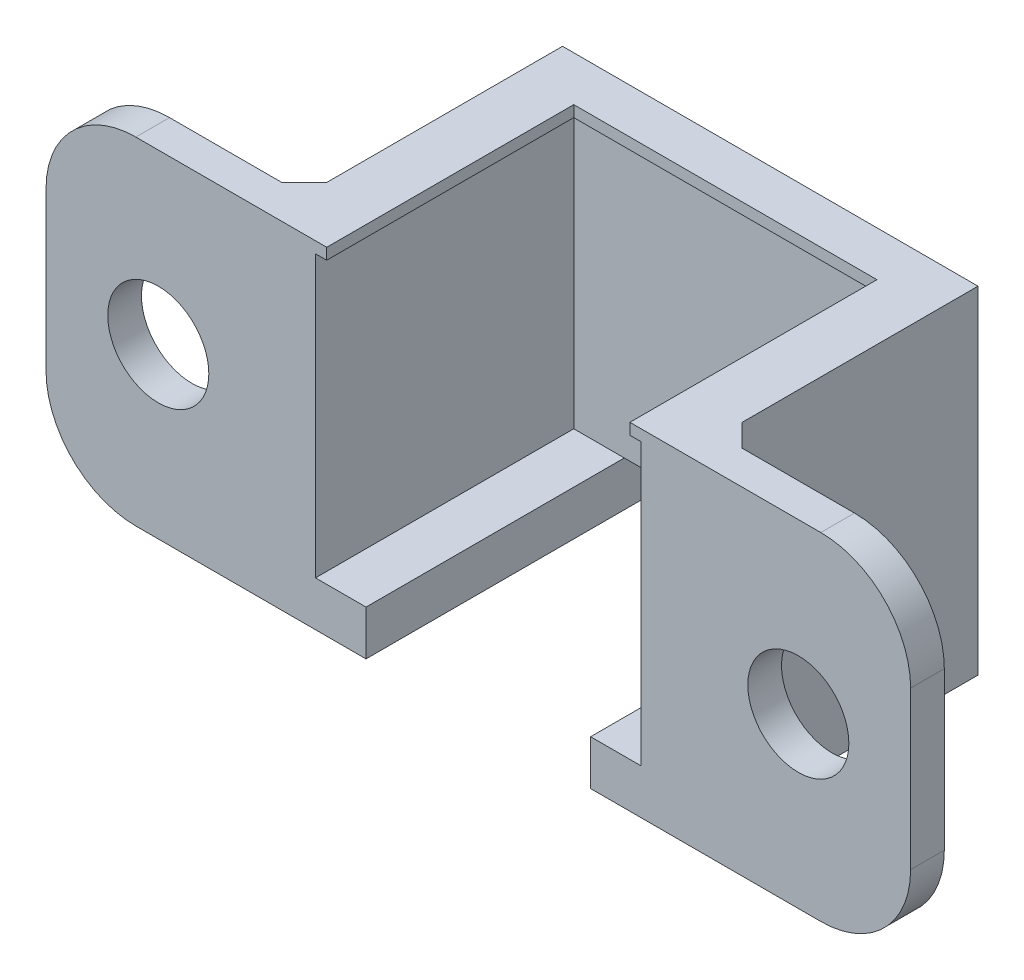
ISO-10303-21;
HEADER;
FILE_DESCRIPTION(('STEP AP214'),'2;1');
FILE_NAME('part.step','',(''),(''),'','','');
FILE_SCHEMA(('AUTOMOTIVE_DESIGN { 1 0 10303 214 1 1 1 1 }'));
ENDSEC;
DATA;
#1=APPLICATION_CONTEXT('core data for automotive mechanical design processes');
#2=APPLICATION_PROTOCOL_DEFINITION('international standard','automotive_design',2000,#1);
#3=PRODUCT_CONTEXT('',#1,'mechanical');
#4=PRODUCT('Part','Part','',(#3));
#5=PRODUCT_RELATED_PRODUCT_CATEGORY('part','',(#4));
#6=PRODUCT_DEFINITION_FORMATION('','',#4);
#7=PRODUCT_DEFINITION_CONTEXT('part definition',#1,'design');
#8=PRODUCT_DEFINITION('design','',#6,#7);
#9=PRODUCT_DEFINITION_SHAPE('','',#8);
#10=(LENGTH_UNIT() NAMED_UNIT(*) SI_UNIT(.MILLI.,.METRE.));
#11=(NAMED_UNIT(*) PLANE_ANGLE_UNIT() SI_UNIT($,.RADIAN.));
#12=(NAMED_UNIT(*) SI_UNIT($,.STERADIAN.) SOLID_ANGLE_UNIT());
#13=UNCERTAINTY_MEASURE_WITH_UNIT(LENGTH_MEASURE(1.E-05),#10,'distance_accuracy_value','');
#14=(GEOMETRIC_REPRESENTATION_CONTEXT(3) GLOBAL_UNCERTAINTY_ASSIGNED_CONTEXT((#13)) GLOBAL_UNIT_ASSIGNED_CONTEXT((#10,
#11,#12)) REPRESENTATION_CONTEXT('',''));
#15=CARTESIAN_POINT('',(0.,0.,0.));
#16=DIRECTION('',(0.,0.,1.));
#17=DIRECTION('',(1.,0.,0.));
#18=AXIS2_PLACEMENT_3D('',#15,#16,#17);
#19=CARTESIAN_POINT('',(0.,2.,13.));
#20=DIRECTION('',(0.,1.,0.));
#21=DIRECTION('',(-1.,0.,0.));
#22=AXIS2_PLACEMENT_3D('',#19,#20,#21);
#23=PLANE('',#22);
#24=DIRECTION('',(0.,0.,-1.));
#25=VECTOR('',#24,1.);
#26=CARTESIAN_POINT('',(4.25,2.,0.));
#27=LINE('',#26,#25);
#28=CARTESIAN_POINT('',(4.25,2.,13.));
#29=VERTEX_POINT('',#28);
#30=CARTESIAN_POINT('',(4.25,2.,1.5));
#31=VERTEX_POINT('',#30);
#32=EDGE_CURVE('E275',#29,#31,#27,.T.);
#33=ORIENTED_EDGE('',*,*,#32,.T.);
#34=DIRECTION('',(1.,0.,0.));
#35=VECTOR('',#34,1.);
#36=CARTESIAN_POINT('',(0.,2.,1.5));
#37=LINE('',#36,#35);
#38=CARTESIAN_POINT('',(2.,2.,1.5));
#39=VERTEX_POINT('',#38);
#40=EDGE_CURVE('E295',#39,#31,#37,.T.);
#41=ORIENTED_EDGE('',*,*,#40,.F.);
#42=DIRECTION('',(0.,0.,-1.));
#43=VECTOR('',#42,1.);
#44=CARTESIAN_POINT('',(2.,2.,13.));
#45=LINE('',#44,#43);
#46=CARTESIAN_POINT('',(2.,2.,13.));
#47=VERTEX_POINT('',#46);
#48=EDGE_CURVE('E338',#47,#39,#45,.T.);
#49=ORIENTED_EDGE('',*,*,#48,.F.);
#50=DIRECTION('',(1.,0.,0.));
#51=VECTOR('',#50,1.);
#52=CARTESIAN_POINT('',(0.,2.,13.));
#53=LINE('',#52,#51);
#54=EDGE_CURVE('E310',#47,#29,#53,.T.);
#55=ORIENTED_EDGE('',*,*,#54,.T.);
#56=EDGE_LOOP('',(#33,#41,#49,#55));
#57=FACE_BOUND('',#56,.T.);
#58=ADVANCED_FACE('F34',(#57),#23,.T.);
#59=CARTESIAN_POINT('',(0.,0.,13.));
#60=DIRECTION('',(0.,1.,0.));
#61=DIRECTION('',(0.,0.,1.));
#62=AXIS2_PLACEMENT_3D('',#59,#60,#61);
#63=PLANE('',#62);
#64=DIRECTION('',(1.,0.,0.));
#65=VECTOR('',#64,1.);
#66=CARTESIAN_POINT('',(0.,0.,13.));
#67=LINE('',#66,#65);
#68=CARTESIAN_POINT('',(-6.00000000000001,0.,13.));
#69=VERTEX_POINT('',#68);
#70=CARTESIAN_POINT('',(4.25,0.,13.));
#71=VERTEX_POINT('',#70);
#72=EDGE_CURVE('E317',#69,#71,#67,.T.);
#73=ORIENTED_EDGE('',*,*,#72,.F.);
#74=DIRECTION('',(0.,0.,1.));
#75=VECTOR('',#74,1.);
#76=CARTESIAN_POINT('',(-6.00000000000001,0.,13.));
#77=LINE('',#76,#75);
#78=CARTESIAN_POINT('',(-6.00000000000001,0.,11.5));
#79=VERTEX_POINT('',#78);
#80=EDGE_CURVE('E372',#69,#79,#77,.F.);
#81=ORIENTED_EDGE('',*,*,#80,.T.);
#82=DIRECTION('',(-1.,0.,0.));
#83=VECTOR('',#82,1.);
#84=CARTESIAN_POINT('',(0.,0.,11.5));
#85=LINE('',#84,#83);
#86=CARTESIAN_POINT('',(-1.00000000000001,0.,11.5));
#87=VERTEX_POINT('',#86);
#88=EDGE_CURVE('E420',#87,#79,#85,.T.);
#89=ORIENTED_EDGE('',*,*,#88,.F.);
#90=DIRECTION('',(-0.707106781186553,0.,0.707106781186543));
#91=VECTOR('',#90,1.);
#92=CARTESIAN_POINT('',(-1.25,0.,11.75));
#93=LINE('',#92,#91);
#94=CARTESIAN_POINT('',(0.,0.,10.5));
#95=VERTEX_POINT('',#94);
#96=EDGE_CURVE('E391',#87,#95,#93,.F.);
#97=ORIENTED_EDGE('',*,*,#96,.T.);
#98=DIRECTION('',(0.,0.,-1.));
#99=VECTOR('',#98,1.);
#100=CARTESIAN_POINT('',(0.,0.,13.));
#101=LINE('',#100,#99);
#102=CARTESIAN_POINT('',(0.,0.,0.));
#103=VERTEX_POINT('',#102);
#104=EDGE_CURVE('E334',#95,#103,#101,.T.);
#105=ORIENTED_EDGE('',*,*,#104,.T.);
#106=DIRECTION('',(1.,0.,0.));
#107=VECTOR('',#106,1.);
#108=CARTESIAN_POINT('',(0.,0.,0.));
#109=LINE('',#108,#107);
#110=CARTESIAN_POINT('',(4.25,0.,0.));
#111=VERTEX_POINT('',#110);
#112=EDGE_CURVE('E326',#103,#111,#109,.T.);
#113=ORIENTED_EDGE('',*,*,#112,.T.);
#114=DIRECTION('',(0.,0.,-1.));
#115=VECTOR('',#114,1.);
#116=CARTESIAN_POINT('',(4.25,0.,0.));
#117=LINE('',#116,#115);
#118=EDGE_CURVE('E271',#71,#111,#117,.T.);
#119=ORIENTED_EDGE('',*,*,#118,.F.);
#120=EDGE_LOOP('',(#73,#81,#89,#97,#105,#113,#119));
#121=FACE_BOUND('',#120,.T.);
#122=ADVANCED_FACE('F418',(#121),#63,.F.);
#123=CARTESIAN_POINT('',(0.,0.,13.));
#124=DIRECTION('',(0.,0.,1.));
#125=DIRECTION('',(1.,0.,0.));
#126=AXIS2_PLACEMENT_3D('',#123,#124,#125);
#127=PLANE('',#126);
#128=CARTESIAN_POINT('',(-5.,7.49999999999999,13.));
#129=DIRECTION('',(0.,0.,1.));
#130=DIRECTION('',(1.,0.,0.));
#131=AXIS2_PLACEMENT_3D('',#128,#129,#130);
#132=CIRCLE('',#131,2.25);
#133=CARTESIAN_POINT('',(-2.75000000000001,7.49999999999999,13.));
#134=VERTEX_POINT('',#133);
#135=EDGE_CURVE('E464',#134,#134,#132,.T.);
#136=ORIENTED_EDGE('',*,*,#135,.F.);
#137=EDGE_LOOP('',(#136));
#138=FACE_BOUND('',#137,.T.);
#139=DIRECTION('',(0.,1.,0.));
#140=VECTOR('',#139,1.);
#141=CARTESIAN_POINT('',(-10.,0.,13.));
#142=LINE('',#141,#140);
#143=CARTESIAN_POINT('',(-10.,4.,13.));
#144=VERTEX_POINT('',#143);
#145=CARTESIAN_POINT('',(-10.,11.,13.));
#146=VERTEX_POINT('',#145);
#147=EDGE_CURVE('E412',#144,#146,#142,.T.);
#148=ORIENTED_EDGE('',*,*,#147,.F.);
#149=CARTESIAN_POINT('',(-6.00000000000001,4.,13.));
#150=DIRECTION('',(0.,0.,1.));
#151=DIRECTION('',(1.,0.,0.));
#152=AXIS2_PLACEMENT_3D('',#149,#150,#151);
#153=CIRCLE('',#152,4.);
#154=EDGE_CURVE('E370',#144,#69,#153,.T.);
#155=ORIENTED_EDGE('',*,*,#154,.T.);
#156=ORIENTED_EDGE('',*,*,#72,.T.);
#157=DIRECTION('',(0.,-1.,0.));
#158=VECTOR('',#157,1.);
#159=CARTESIAN_POINT('',(4.25,2.,13.));
#160=LINE('',#159,#158);
#161=EDGE_CURVE('E285',#29,#71,#160,.T.);
#162=ORIENTED_EDGE('',*,*,#161,.F.);
#163=ORIENTED_EDGE('',*,*,#54,.F.);
#164=DIRECTION('',(0.,1.,0.));
#165=VECTOR('',#164,1.);
#166=CARTESIAN_POINT('',(2.,0.,13.));
#167=LINE('',#166,#165);
#168=CARTESIAN_POINT('',(2.,14.5,13.));
#169=VERTEX_POINT('',#168);
#170=EDGE_CURVE('E241',#47,#169,#167,.T.);
#171=ORIENTED_EDGE('',*,*,#170,.T.);
#172=DIRECTION('',(1.,0.,0.));
#173=VECTOR('',#172,1.);
#174=CARTESIAN_POINT('',(2.5,14.5,13.));
#175=LINE('',#174,#173);
#176=CARTESIAN_POINT('',(2.5,14.5,13.));
#177=VERTEX_POINT('',#176);
#178=EDGE_CURVE('E231',#169,#177,#175,.T.);
#179=ORIENTED_EDGE('',*,*,#178,.T.);
#180=DIRECTION('',(0.,1.,0.));
#181=VECTOR('',#180,1.);
#182=CARTESIAN_POINT('',(2.5,14.5,13.));
#183=LINE('',#182,#181);
#184=CARTESIAN_POINT('',(2.5,15.,13.));
#185=VERTEX_POINT('',#184);
#186=EDGE_CURVE('E213',#177,#185,#183,.T.);
#187=ORIENTED_EDGE('',*,*,#186,.T.);
#188=DIRECTION('',(1.,0.,0.));
#189=VECTOR('',#188,1.);
#190=CARTESIAN_POINT('',(0.,15.,13.));
#191=LINE('',#190,#189);
#192=CARTESIAN_POINT('',(-6.,15.,13.));
#193=VERTEX_POINT('',#192);
#194=EDGE_CURVE('E314',#193,#185,#191,.T.);
#195=ORIENTED_EDGE('',*,*,#194,.F.);
#196=CARTESIAN_POINT('',(-6.00000000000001,11.,13.));
#197=DIRECTION('',(0.,0.,1.));
#198=DIRECTION('',(1.,0.,0.));
#199=AXIS2_PLACEMENT_3D('',#196,#197,#198);
#200=CIRCLE('',#199,4.);
#201=EDGE_CURVE('E368',#193,#146,#200,.T.);
#202=ORIENTED_EDGE('',*,*,#201,.T.);
#203=EDGE_LOOP('',(#148,#155,#156,#162,#163,#171,#179,#187,#195,#202));
#204=FACE_BOUND('',#203,.T.);
#205=ADVANCED_FACE('F238',(#138,#204),#127,.T.);
#206=CARTESIAN_POINT('',(16.5,0.,13.));
#207=DIRECTION('',(-1.,0.,0.));
#208=DIRECTION('',(0.,0.,1.));
#209=AXIS2_PLACEMENT_3D('',#206,#207,#208);
#210=PLANE('',#209);
#211=DIRECTION('',(0.,0.,-1.));
#212=VECTOR('',#211,1.);
#213=CARTESIAN_POINT('',(16.5,14.5,13.));
#214=LINE('',#213,#212);
#215=CARTESIAN_POINT('',(16.5,14.5,13.));
#216=VERTEX_POINT('',#215);
#217=CARTESIAN_POINT('',(16.5,14.5,1.5));
#218=VERTEX_POINT('',#217);
#219=EDGE_CURVE('E441',#216,#218,#214,.T.);
#220=ORIENTED_EDGE('',*,*,#219,.T.);
#221=DIRECTION('',(0.,1.,0.));
#222=VECTOR('',#221,1.);
#223=CARTESIAN_POINT('',(16.5,0.,1.5));
#224=LINE('',#223,#222);
#225=CARTESIAN_POINT('',(16.5,2.,1.5));
#226=VERTEX_POINT('',#225);
#227=EDGE_CURVE('E298',#226,#218,#224,.T.);
#228=ORIENTED_EDGE('',*,*,#227,.F.);
#229=DIRECTION('',(0.,0.,-1.));
#230=VECTOR('',#229,1.);
#231=CARTESIAN_POINT('',(16.5,2.,13.));
#232=LINE('',#231,#230);
#233=CARTESIAN_POINT('',(16.5,2.,13.));
#234=VERTEX_POINT('',#233);
#235=EDGE_CURVE('E341',#234,#226,#232,.T.);
#236=ORIENTED_EDGE('',*,*,#235,.F.);
#237=DIRECTION('',(0.,1.,0.));
#238=VECTOR('',#237,1.);
#239=CARTESIAN_POINT('',(16.5,0.,13.));
#240=LINE('',#239,#238);
#241=EDGE_CURVE('E306',#234,#216,#240,.T.);
#242=ORIENTED_EDGE('',*,*,#241,.T.);
#243=EDGE_LOOP('',(#220,#228,#236,#242));
#244=FACE_BOUND('',#243,.T.);
#245=ADVANCED_FACE('F499',(#244),#210,.T.);
#246=DIRECTION('',(0.,0.,1.));
#247=VECTOR('',#246,1.);
#248=CARTESIAN_POINT('',(14.25,2.,13.));
#249=LINE('',#248,#247);
#250=CARTESIAN_POINT('',(14.25,2.,1.5));
#251=VERTEX_POINT('',#250);
#252=CARTESIAN_POINT('',(14.25,2.,13.));
#253=VERTEX_POINT('',#252);
#254=EDGE_CURVE('E270',#251,#253,#249,.T.);
#255=ORIENTED_EDGE('',*,*,#254,.T.);
#256=EDGE_CURVE('E309',#253,#234,#53,.T.);
#257=ORIENTED_EDGE('',*,*,#256,.T.);
#258=ORIENTED_EDGE('',*,*,#235,.T.);
#259=EDGE_CURVE('E294',#251,#226,#37,.T.);
#260=ORIENTED_EDGE('',*,*,#259,.F.);
#261=EDGE_LOOP('',(#255,#257,#258,#260));
#262=FACE_BOUND('',#261,.T.);
#263=ADVANCED_FACE('F490',(#262),#23,.T.);
#264=CARTESIAN_POINT('',(2.,0.,13.));
#265=DIRECTION('',(-1.,0.,0.));
#266=DIRECTION('',(0.,0.,1.));
#267=AXIS2_PLACEMENT_3D('',#264,#265,#266);
#268=PLANE('',#267);
#269=DIRECTION('',(0.,1.,0.));
#270=VECTOR('',#269,1.);
#271=CARTESIAN_POINT('',(2.,0.,1.5));
#272=LINE('',#271,#270);
#273=CARTESIAN_POINT('',(2.,14.5,1.5));
#274=VERTEX_POINT('',#273);
#275=EDGE_CURVE('E284',#39,#274,#272,.T.);
#276=ORIENTED_EDGE('',*,*,#275,.T.);
#277=DIRECTION('',(0.,0.,1.));
#278=VECTOR('',#277,1.);
#279=CARTESIAN_POINT('',(2.,14.5,13.));
#280=LINE('',#279,#278);
#281=EDGE_CURVE('E242',#274,#169,#280,.T.);
#282=ORIENTED_EDGE('',*,*,#281,.T.);
#283=ORIENTED_EDGE('',*,*,#170,.F.);
#284=ORIENTED_EDGE('',*,*,#48,.T.);
#285=EDGE_LOOP('',(#276,#282,#283,#284));
#286=FACE_BOUND('',#285,.T.);
#287=ADVANCED_FACE('F438',(#286),#268,.F.);
#288=CARTESIAN_POINT('',(0.,15.,13.));
#289=DIRECTION('',(0.,1.,0.));
#290=DIRECTION('',(-1.,0.,0.));
#291=AXIS2_PLACEMENT_3D('',#288,#289,#290);
#292=PLANE('',#291);
#293=DIRECTION('',(1.,0.,0.));
#294=VECTOR('',#293,1.);
#295=CARTESIAN_POINT('',(0.,15.,11.5));
#296=LINE('',#295,#294);
#297=CARTESIAN_POINT('',(-6.,15.,11.5));
#298=VERTEX_POINT('',#297);
#299=CARTESIAN_POINT('',(-1.00000000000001,15.,11.5));
#300=VERTEX_POINT('',#299);
#301=EDGE_CURVE('E400',#298,#300,#296,.T.);
#302=ORIENTED_EDGE('',*,*,#301,.F.);
#303=DIRECTION('',(0.,0.,1.));
#304=VECTOR('',#303,1.);
#305=CARTESIAN_POINT('',(-6.,15.,13.));
#306=LINE('',#305,#304);
#307=EDGE_CURVE('E379',#298,#193,#306,.T.);
#308=ORIENTED_EDGE('',*,*,#307,.T.);
#309=ORIENTED_EDGE('',*,*,#194,.T.);
#310=DIRECTION('',(0.,0.,-1.));
#311=VECTOR('',#310,1.);
#312=CARTESIAN_POINT('',(2.5,15.,13.));
#313=LINE('',#312,#311);
#314=CARTESIAN_POINT('',(2.5,15.,2.));
#315=VERTEX_POINT('',#314);
#316=EDGE_CURVE('E218',#185,#315,#313,.T.);
#317=ORIENTED_EDGE('',*,*,#316,.T.);
#318=DIRECTION('',(1.,0.,0.));
#319=VECTOR('',#318,1.);
#320=CARTESIAN_POINT('',(16.,15.,2.));
#321=LINE('',#320,#319);
#322=CARTESIAN_POINT('',(16.,15.,2.));
#323=VERTEX_POINT('',#322);
#324=EDGE_CURVE('E252',#315,#323,#321,.T.);
#325=ORIENTED_EDGE('',*,*,#324,.T.);
#326=DIRECTION('',(0.,0.,1.));
#327=VECTOR('',#326,1.);
#328=CARTESIAN_POINT('',(16.,15.,13.));
#329=LINE('',#328,#327);
#330=CARTESIAN_POINT('',(16.,15.,13.));
#331=VERTEX_POINT('',#330);
#332=EDGE_CURVE('E256',#323,#331,#329,.T.);
#333=ORIENTED_EDGE('',*,*,#332,.T.);
#334=DIRECTION('',(1.,0.,0.));
#335=VECTOR('',#334,1.);
#336=CARTESIAN_POINT('',(0.,15.,13.));
#337=LINE('',#336,#335);
#338=CARTESIAN_POINT('',(24.5,15.,13.));
#339=VERTEX_POINT('',#338);
#340=EDGE_CURVE('E303',#331,#339,#337,.T.);
#341=ORIENTED_EDGE('',*,*,#340,.T.);
#342=DIRECTION('',(0.,0.,1.));
#343=VECTOR('',#342,1.);
#344=CARTESIAN_POINT('',(24.5,15.,13.));
#345=LINE('',#344,#343);
#346=CARTESIAN_POINT('',(24.5,15.,11.5));
#347=VERTEX_POINT('',#346);
#348=EDGE_CURVE('E361',#339,#347,#345,.F.);
#349=ORIENTED_EDGE('',*,*,#348,.T.);
#350=DIRECTION('',(-1.,0.,0.));
#351=VECTOR('',#350,1.);
#352=CARTESIAN_POINT('',(18.5,15.,11.5));
#353=LINE('',#352,#351);
#354=CARTESIAN_POINT('',(19.5,15.,11.5));
#355=VERTEX_POINT('',#354);
#356=EDGE_CURVE('E253',#347,#355,#353,.T.);
#357=ORIENTED_EDGE('',*,*,#356,.T.);
#358=DIRECTION('',(-0.707106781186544,0.,-0.707106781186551));
#359=VECTOR('',#358,1.);
#360=CARTESIAN_POINT('',(18.5,15.,10.5));
#361=LINE('',#360,#359);
#362=CARTESIAN_POINT('',(18.5,15.,10.5));
#363=VERTEX_POINT('',#362);
#364=EDGE_CURVE('E11',#355,#363,#361,.T.);
#365=ORIENTED_EDGE('',*,*,#364,.T.);
#366=DIRECTION('',(0.,0.,-1.));
#367=VECTOR('',#366,1.);
#368=CARTESIAN_POINT('',(18.5,15.,13.));
#369=LINE('',#368,#367);
#370=CARTESIAN_POINT('',(18.5,15.,0.));
#371=VERTEX_POINT('',#370);
#372=EDGE_CURVE('E319',#363,#371,#369,.T.);
#373=ORIENTED_EDGE('',*,*,#372,.T.);
#374=DIRECTION('',(1.,0.,0.));
#375=VECTOR('',#374,1.);
#376=CARTESIAN_POINT('',(0.,15.,0.));
#377=LINE('',#376,#375);
#378=CARTESIAN_POINT('',(0.,15.,0.));
#379=VERTEX_POINT('',#378);
#380=EDGE_CURVE('E302',#379,#371,#377,.T.);
#381=ORIENTED_EDGE('',*,*,#380,.F.);
#382=DIRECTION('',(0.,0.,-1.));
#383=VECTOR('',#382,1.);
#384=CARTESIAN_POINT('',(0.,15.,13.));
#385=LINE('',#384,#383);
#386=CARTESIAN_POINT('',(0.,15.,10.5));
#387=VERTEX_POINT('',#386);
#388=EDGE_CURVE('E336',#387,#379,#385,.T.);
#389=ORIENTED_EDGE('',*,*,#388,.F.);
#390=DIRECTION('',(0.707106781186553,0.,-0.707106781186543));
#391=VECTOR('',#390,1.);
#392=CARTESIAN_POINT('',(-1.00000000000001,15.,11.5));
#393=LINE('',#392,#391);
#394=EDGE_CURVE('E393',#387,#300,#393,.F.);
#395=ORIENTED_EDGE('',*,*,#394,.T.);
#396=EDGE_LOOP('',(#302,#308,#309,#317,#325,#333,#341,#349,#357,#365,#373,#381,#389,#395));
#397=FACE_BOUND('',#396,.T.);
#398=ADVANCED_FACE('F399',(#397),#292,.T.);
#399=CARTESIAN_POINT('',(0.,0.,13.));
#400=DIRECTION('',(-1.,0.,0.));
#401=DIRECTION('',(0.,0.,1.));
#402=AXIS2_PLACEMENT_3D('',#399,#400,#401);
#403=PLANE('',#402);
#404=ORIENTED_EDGE('',*,*,#104,.F.);
#405=DIRECTION('',(0.,1.,0.));
#406=VECTOR('',#405,1.);
#407=CARTESIAN_POINT('',(0.,15.,10.5));
#408=LINE('',#407,#406);
#409=EDGE_CURVE('E385',#95,#387,#408,.T.);
#410=ORIENTED_EDGE('',*,*,#409,.T.);
#411=ORIENTED_EDGE('',*,*,#388,.T.);
#412=DIRECTION('',(0.,1.,0.));
#413=VECTOR('',#412,1.);
#414=CARTESIAN_POINT('',(0.,0.,0.));
#415=LINE('',#414,#413);
#416=EDGE_CURVE('E322',#103,#379,#415,.T.);
#417=ORIENTED_EDGE('',*,*,#416,.F.);
#418=EDGE_LOOP('',(#404,#410,#411,#417));
#419=FACE_BOUND('',#418,.T.);
#420=ADVANCED_FACE('F423',(#419),#403,.T.);
#421=DIRECTION('',(0.,0.,-1.));
#422=VECTOR('',#421,1.);
#423=CARTESIAN_POINT('',(18.5,0.,13.));
#424=LINE('',#423,#422);
#425=CARTESIAN_POINT('',(18.5,0.,10.5));
#426=VERTEX_POINT('',#425);
#427=CARTESIAN_POINT('',(18.5,0.,0.));
#428=VERTEX_POINT('',#427);
#429=EDGE_CURVE('E332',#426,#428,#424,.T.);
#430=ORIENTED_EDGE('',*,*,#429,.F.);
#431=DIRECTION('',(0.707106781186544,0.,0.707106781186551));
#432=VECTOR('',#431,1.);
#433=CARTESIAN_POINT('',(10.5000000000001,0.,2.50000000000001));
#434=LINE('',#433,#432);
#435=CARTESIAN_POINT('',(19.5,0.,11.5));
#436=VERTEX_POINT('',#435);
#437=EDGE_CURVE('E42',#426,#436,#434,.T.);
#438=ORIENTED_EDGE('',*,*,#437,.T.);
#439=DIRECTION('',(1.,0.,0.));
#440=VECTOR('',#439,1.);
#441=CARTESIAN_POINT('',(18.5,0.,11.5));
#442=LINE('',#441,#440);
#443=CARTESIAN_POINT('',(24.5,0.,11.5));
#444=VERTEX_POINT('',#443);
#445=EDGE_CURVE('E450',#436,#444,#442,.T.);
#446=ORIENTED_EDGE('',*,*,#445,.T.);
#447=DIRECTION('',(0.,0.,1.));
#448=VECTOR('',#447,1.);
#449=CARTESIAN_POINT('',(24.5,0.,13.));
#450=LINE('',#449,#448);
#451=CARTESIAN_POINT('',(24.5,0.,13.));
#452=VERTEX_POINT('',#451);
#453=EDGE_CURVE('E344',#444,#452,#450,.T.);
#454=ORIENTED_EDGE('',*,*,#453,.T.);
#455=CARTESIAN_POINT('',(14.25,0.,13.));
#456=VERTEX_POINT('',#455);
#457=EDGE_CURVE('E316',#456,#452,#67,.T.);
#458=ORIENTED_EDGE('',*,*,#457,.F.);
#459=DIRECTION('',(0.,0.,1.));
#460=VECTOR('',#459,1.);
#461=CARTESIAN_POINT('',(14.25,0.,13.));
#462=LINE('',#461,#460);
#463=CARTESIAN_POINT('',(14.25,0.,0.));
#464=VERTEX_POINT('',#463);
#465=EDGE_CURVE('E263',#464,#456,#462,.T.);
#466=ORIENTED_EDGE('',*,*,#465,.F.);
#467=EDGE_CURVE('E325',#464,#428,#109,.T.);
#468=ORIENTED_EDGE('',*,*,#467,.T.);
#469=EDGE_LOOP('',(#430,#438,#446,#454,#458,#466,#468));
#470=FACE_BOUND('',#469,.T.);
#471=ADVANCED_FACE('F495',(#470),#63,.F.);
#472=CARTESIAN_POINT('',(18.5,0.,13.));
#473=DIRECTION('',(-1.,0.,0.));
#474=DIRECTION('',(0.,0.,1.));
#475=AXIS2_PLACEMENT_3D('',#472,#473,#474);
#476=PLANE('',#475);
#477=ORIENTED_EDGE('',*,*,#372,.F.);
#478=DIRECTION('',(0.,-1.,0.));
#479=VECTOR('',#478,1.);
#480=CARTESIAN_POINT('',(18.5,0.,10.5));
#481=LINE('',#480,#479);
#482=EDGE_CURVE('E387',#363,#426,#481,.T.);
#483=ORIENTED_EDGE('',*,*,#482,.T.);
#484=ORIENTED_EDGE('',*,*,#429,.T.);
#485=DIRECTION('',(0.,1.,0.));
#486=VECTOR('',#485,1.);
#487=CARTESIAN_POINT('',(18.5,0.,0.));
#488=LINE('',#487,#486);
#489=EDGE_CURVE('E307',#428,#371,#488,.T.);
#490=ORIENTED_EDGE('',*,*,#489,.T.);
#491=EDGE_LOOP('',(#477,#483,#484,#490));
#492=FACE_BOUND('',#491,.T.);
#493=ADVANCED_FACE('F529',(#492),#476,.F.);
#494=CARTESIAN_POINT('',(23.5,7.49999999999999,13.));
#495=DIRECTION('',(0.,0.,1.));
#496=DIRECTION('',(1.,0.,0.));
#497=AXIS2_PLACEMENT_3D('',#494,#495,#496);
#498=CIRCLE('',#497,2.25);
#499=CARTESIAN_POINT('',(25.75,7.49999999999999,13.));
#500=VERTEX_POINT('',#499);
#501=EDGE_CURVE('E451',#500,#500,#498,.T.);
#502=ORIENTED_EDGE('',*,*,#501,.F.);
#503=EDGE_LOOP('',(#502));
#504=FACE_BOUND('',#503,.T.);
#505=ORIENTED_EDGE('',*,*,#457,.T.);
#506=CARTESIAN_POINT('',(24.5,4.,13.));
#507=DIRECTION('',(0.,0.,1.));
#508=DIRECTION('',(1.,0.,0.));
#509=AXIS2_PLACEMENT_3D('',#506,#507,#508);
#510=CIRCLE('',#509,4.);
#511=CARTESIAN_POINT('',(28.5,4.,13.));
#512=VERTEX_POINT('',#511);
#513=EDGE_CURVE('E349',#452,#512,#510,.T.);
#514=ORIENTED_EDGE('',*,*,#513,.T.);
#515=DIRECTION('',(0.,1.,0.));
#516=VECTOR('',#515,1.);
#517=CARTESIAN_POINT('',(28.5,0.,13.));
#518=LINE('',#517,#516);
#519=CARTESIAN_POINT('',(28.5,11.,13.));
#520=VERTEX_POINT('',#519);
#521=EDGE_CURVE('E447',#512,#520,#518,.T.);
#522=ORIENTED_EDGE('',*,*,#521,.T.);
#523=CARTESIAN_POINT('',(24.5,11.,13.));
#524=DIRECTION('',(0.,0.,1.));
#525=DIRECTION('',(1.,0.,0.));
#526=AXIS2_PLACEMENT_3D('',#523,#524,#525);
#527=CIRCLE('',#526,4.);
#528=EDGE_CURVE('E347',#520,#339,#527,.T.);
#529=ORIENTED_EDGE('',*,*,#528,.T.);
#530=ORIENTED_EDGE('',*,*,#340,.F.);
#531=DIRECTION('',(0.,1.,0.));
#532=VECTOR('',#531,1.);
#533=CARTESIAN_POINT('',(16.,14.5,13.));
#534=LINE('',#533,#532);
#535=CARTESIAN_POINT('',(16.,14.5,13.));
#536=VERTEX_POINT('',#535);
#537=EDGE_CURVE('E260',#536,#331,#534,.T.);
#538=ORIENTED_EDGE('',*,*,#537,.F.);
#539=DIRECTION('',(1.,0.,0.));
#540=VECTOR('',#539,1.);
#541=CARTESIAN_POINT('',(16.5,14.5,13.));
#542=LINE('',#541,#540);
#543=EDGE_CURVE('E259',#536,#216,#542,.T.);
#544=ORIENTED_EDGE('',*,*,#543,.T.);
#545=ORIENTED_EDGE('',*,*,#241,.F.);
#546=ORIENTED_EDGE('',*,*,#256,.F.);
#547=DIRECTION('',(0.,-1.,0.));
#548=VECTOR('',#547,1.);
#549=CARTESIAN_POINT('',(14.25,2.,13.));
#550=LINE('',#549,#548);
#551=EDGE_CURVE('E288',#253,#456,#550,.T.);
#552=ORIENTED_EDGE('',*,*,#551,.T.);
#553=EDGE_LOOP('',(#505,#514,#522,#529,#530,#538,#544,#545,#546,#552));
#554=FACE_BOUND('',#553,.T.);
#555=ADVANCED_FACE('F516',(#504,#554),#127,.T.);
#556=CARTESIAN_POINT('',(0.,0.,0.));
#557=DIRECTION('',(0.,0.,1.));
#558=DIRECTION('',(1.,0.,0.));
#559=AXIS2_PLACEMENT_3D('',#556,#557,#558);
#560=PLANE('',#559);
#561=DIRECTION('',(1.,0.,0.));
#562=VECTOR('',#561,1.);
#563=CARTESIAN_POINT('',(14.25,2.,0.));
#564=LINE('',#563,#562);
#565=CARTESIAN_POINT('',(4.25,2.,0.));
#566=VERTEX_POINT('',#565);
#567=CARTESIAN_POINT('',(14.25,2.,0.));
#568=VERTEX_POINT('',#567);
#569=EDGE_CURVE('E267',#566,#568,#564,.T.);
#570=ORIENTED_EDGE('',*,*,#569,.F.);
#571=DIRECTION('',(0.,-1.,0.));
#572=VECTOR('',#571,1.);
#573=CARTESIAN_POINT('',(4.25,2.,0.));
#574=LINE('',#573,#572);
#575=EDGE_CURVE('E281',#566,#111,#574,.T.);
#576=ORIENTED_EDGE('',*,*,#575,.T.);
#577=ORIENTED_EDGE('',*,*,#112,.F.);
#578=ORIENTED_EDGE('',*,*,#416,.T.);
#579=ORIENTED_EDGE('',*,*,#380,.T.);
#580=ORIENTED_EDGE('',*,*,#489,.F.);
#581=ORIENTED_EDGE('',*,*,#467,.F.);
#582=DIRECTION('',(0.,-1.,0.));
#583=VECTOR('',#582,1.);
#584=CARTESIAN_POINT('',(14.25,2.,0.));
#585=LINE('',#584,#583);
#586=EDGE_CURVE('E278',#568,#464,#585,.T.);
#587=ORIENTED_EDGE('',*,*,#586,.F.);
#588=EDGE_LOOP('',(#570,#576,#577,#578,#579,#580,#581,#587));
#589=FACE_BOUND('',#588,.T.);
#590=ADVANCED_FACE('F426',(#589),#560,.F.);
#591=CARTESIAN_POINT('',(0.,0.,1.5));
#592=DIRECTION('',(0.,0.,1.));
#593=DIRECTION('',(1.,0.,0.));
#594=AXIS2_PLACEMENT_3D('',#591,#592,#593);
#595=PLANE('',#594);
#596=DIRECTION('',(-1.,0.,0.));
#597=VECTOR('',#596,1.);
#598=CARTESIAN_POINT('',(2.,14.5,1.5));
#599=LINE('',#598,#597);
#600=EDGE_CURVE('E244',#218,#274,#599,.T.);
#601=ORIENTED_EDGE('',*,*,#600,.T.);
#602=ORIENTED_EDGE('',*,*,#275,.F.);
#603=ORIENTED_EDGE('',*,*,#40,.T.);
#604=EDGE_CURVE('E299',#31,#251,#37,.T.);
#605=ORIENTED_EDGE('',*,*,#604,.T.);
#606=ORIENTED_EDGE('',*,*,#259,.T.);
#607=ORIENTED_EDGE('',*,*,#227,.T.);
#608=EDGE_LOOP('',(#601,#602,#603,#605,#606,#607));
#609=FACE_BOUND('',#608,.T.);
#610=ADVANCED_FACE('F519',(#609),#595,.T.);
#611=CARTESIAN_POINT('',(4.25,2.,0.));
#612=DIRECTION('',(-1.,0.,0.));
#613=DIRECTION('',(0.,0.,1.));
#614=AXIS2_PLACEMENT_3D('',#611,#612,#613);
#615=PLANE('',#614);
#616=ORIENTED_EDGE('',*,*,#118,.T.);
#617=ORIENTED_EDGE('',*,*,#575,.F.);
#618=EDGE_CURVE('E274',#31,#566,#27,.T.);
#619=ORIENTED_EDGE('',*,*,#618,.F.);
#620=ORIENTED_EDGE('',*,*,#32,.F.);
#621=ORIENTED_EDGE('',*,*,#161,.T.);
#622=EDGE_LOOP('',(#616,#617,#619,#620,#621));
#623=FACE_BOUND('',#622,.T.);
#624=ADVANCED_FACE('F432',(#623),#615,.F.);
#625=CARTESIAN_POINT('',(14.25,2.,13.));
#626=DIRECTION('',(1.,0.,0.));
#627=DIRECTION('',(0.,0.,-1.));
#628=AXIS2_PLACEMENT_3D('',#625,#626,#627);
#629=PLANE('',#628);
#630=ORIENTED_EDGE('',*,*,#465,.T.);
#631=ORIENTED_EDGE('',*,*,#551,.F.);
#632=ORIENTED_EDGE('',*,*,#254,.F.);
#633=EDGE_CURVE('E272',#568,#251,#249,.T.);
#634=ORIENTED_EDGE('',*,*,#633,.F.);
#635=ORIENTED_EDGE('',*,*,#586,.T.);
#636=EDGE_LOOP('',(#630,#631,#632,#634,#635));
#637=FACE_BOUND('',#636,.T.);
#638=ADVANCED_FACE('F523',(#637),#629,.F.);
#639=CARTESIAN_POINT('',(0.,2.,0.));
#640=DIRECTION('',(0.,1.,0.));
#641=DIRECTION('',(0.,0.,1.));
#642=AXIS2_PLACEMENT_3D('',#639,#640,#641);
#643=PLANE('',#642);
#644=ORIENTED_EDGE('',*,*,#604,.F.);
#645=ORIENTED_EDGE('',*,*,#618,.T.);
#646=ORIENTED_EDGE('',*,*,#569,.T.);
#647=ORIENTED_EDGE('',*,*,#633,.T.);
#648=EDGE_LOOP('',(#644,#645,#646,#647));
#649=FACE_BOUND('',#648,.T.);
#650=ADVANCED_FACE('F521',(#649),#643,.F.);
#651=CARTESIAN_POINT('',(16.,14.5,13.));
#652=DIRECTION('',(-1.,0.,0.));
#653=DIRECTION('',(0.,0.,1.));
#654=AXIS2_PLACEMENT_3D('',#651,#652,#653);
#655=PLANE('',#654);
#656=ORIENTED_EDGE('',*,*,#332,.F.);
#657=DIRECTION('',(0.,1.,0.));
#658=VECTOR('',#657,1.);
#659=CARTESIAN_POINT('',(16.,14.5,2.));
#660=LINE('',#659,#658);
#661=CARTESIAN_POINT('',(16.,14.5,2.));
#662=VERTEX_POINT('',#661);
#663=EDGE_CURVE('E264',#662,#323,#660,.T.);
#664=ORIENTED_EDGE('',*,*,#663,.F.);
#665=DIRECTION('',(0.,0.,1.));
#666=VECTOR('',#665,1.);
#667=CARTESIAN_POINT('',(16.,14.5,13.));
#668=LINE('',#667,#666);
#669=EDGE_CURVE('E223',#662,#536,#668,.T.);
#670=ORIENTED_EDGE('',*,*,#669,.T.);
#671=ORIENTED_EDGE('',*,*,#537,.T.);
#672=EDGE_LOOP('',(#656,#664,#670,#671));
#673=FACE_BOUND('',#672,.T.);
#674=ADVANCED_FACE('F724',(#673),#655,.T.);
#675=CARTESIAN_POINT('',(16.,14.5,2.));
#676=DIRECTION('',(0.,0.,1.));
#677=DIRECTION('',(1.,0.,0.));
#678=AXIS2_PLACEMENT_3D('',#675,#676,#677);
#679=PLANE('',#678);
#680=ORIENTED_EDGE('',*,*,#324,.F.);
#681=DIRECTION('',(0.,1.,0.));
#682=VECTOR('',#681,1.);
#683=CARTESIAN_POINT('',(2.5,14.5,2.));
#684=LINE('',#683,#682);
#685=CARTESIAN_POINT('',(2.5,14.5,2.));
#686=VERTEX_POINT('',#685);
#687=EDGE_CURVE('E222',#686,#315,#684,.T.);
#688=ORIENTED_EDGE('',*,*,#687,.F.);
#689=DIRECTION('',(1.,0.,0.));
#690=VECTOR('',#689,1.);
#691=CARTESIAN_POINT('',(16.,14.5,2.));
#692=LINE('',#691,#690);
#693=EDGE_CURVE('E234',#686,#662,#692,.T.);
#694=ORIENTED_EDGE('',*,*,#693,.T.);
#695=ORIENTED_EDGE('',*,*,#663,.T.);
#696=EDGE_LOOP('',(#680,#688,#694,#695));
#697=FACE_BOUND('',#696,.T.);
#698=ADVANCED_FACE('F715',(#697),#679,.T.);
#699=CARTESIAN_POINT('',(2.5,14.5,13.));
#700=DIRECTION('',(1.,0.,0.));
#701=DIRECTION('',(0.,0.,-1.));
#702=AXIS2_PLACEMENT_3D('',#699,#700,#701);
#703=PLANE('',#702);
#704=ORIENTED_EDGE('',*,*,#316,.F.);
#705=ORIENTED_EDGE('',*,*,#186,.F.);
#706=DIRECTION('',(0.,0.,-1.));
#707=VECTOR('',#706,1.);
#708=CARTESIAN_POINT('',(2.5,14.5,13.));
#709=LINE('',#708,#707);
#710=EDGE_CURVE('E216',#177,#686,#709,.T.);
#711=ORIENTED_EDGE('',*,*,#710,.T.);
#712=ORIENTED_EDGE('',*,*,#687,.T.);
#713=EDGE_LOOP('',(#704,#705,#711,#712));
#714=FACE_BOUND('',#713,.T.);
#715=ADVANCED_FACE('F215',(#714),#703,.T.);
#716=CARTESIAN_POINT('',(0.,14.5,0.));
#717=DIRECTION('',(0.,-1.,0.));
#718=DIRECTION('',(0.,0.,-1.));
#719=AXIS2_PLACEMENT_3D('',#716,#717,#718);
#720=PLANE('',#719);
#721=ORIENTED_EDGE('',*,*,#543,.F.);
#722=ORIENTED_EDGE('',*,*,#669,.F.);
#723=ORIENTED_EDGE('',*,*,#693,.F.);
#724=ORIENTED_EDGE('',*,*,#710,.F.);
#725=ORIENTED_EDGE('',*,*,#178,.F.);
#726=ORIENTED_EDGE('',*,*,#281,.F.);
#727=ORIENTED_EDGE('',*,*,#600,.F.);
#728=ORIENTED_EDGE('',*,*,#219,.F.);
#729=EDGE_LOOP('',(#721,#722,#723,#724,#725,#726,#727,#728));
#730=FACE_BOUND('',#729,.T.);
#731=ADVANCED_FACE('F229',(#730),#720,.T.);
#732=CARTESIAN_POINT('',(28.5,0.,11.5));
#733=DIRECTION('',(1.,0.,0.));
#734=DIRECTION('',(0.,0.,-1.));
#735=AXIS2_PLACEMENT_3D('',#732,#733,#734);
#736=PLANE('',#735);
#737=ORIENTED_EDGE('',*,*,#521,.F.);
#738=DIRECTION('',(0.,0.,1.));
#739=VECTOR('',#738,1.);
#740=CARTESIAN_POINT('',(28.5,4.,11.5));
#741=LINE('',#740,#739);
#742=CARTESIAN_POINT('',(28.5,4.,11.5));
#743=VERTEX_POINT('',#742);
#744=EDGE_CURVE('E354',#512,#743,#741,.F.);
#745=ORIENTED_EDGE('',*,*,#744,.T.);
#746=DIRECTION('',(0.,1.,0.));
#747=VECTOR('',#746,1.);
#748=CARTESIAN_POINT('',(28.5,0.,11.5));
#749=LINE('',#748,#747);
#750=CARTESIAN_POINT('',(28.5,11.,11.5));
#751=VERTEX_POINT('',#750);
#752=EDGE_CURVE('E453',#743,#751,#749,.T.);
#753=ORIENTED_EDGE('',*,*,#752,.T.);
#754=DIRECTION('',(0.,0.,1.));
#755=VECTOR('',#754,1.);
#756=CARTESIAN_POINT('',(28.5,11.,11.5));
#757=LINE('',#756,#755);
#758=EDGE_CURVE('E351',#751,#520,#757,.T.);
#759=ORIENTED_EDGE('',*,*,#758,.T.);
#760=EDGE_LOOP('',(#737,#745,#753,#759));
#761=FACE_BOUND('',#760,.T.);
#762=ADVANCED_FACE('F541',(#761),#736,.T.);
#763=CARTESIAN_POINT('',(0.,0.,11.5));
#764=DIRECTION('',(0.,0.,-1.));
#765=DIRECTION('',(-1.,0.,0.));
#766=AXIS2_PLACEMENT_3D('',#763,#764,#765);
#767=PLANE('',#766);
#768=CARTESIAN_POINT('',(23.5,7.49999999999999,11.5));
#769=DIRECTION('',(0.,0.,-1.));
#770=DIRECTION('',(-1.,0.,0.));
#771=AXIS2_PLACEMENT_3D('',#768,#769,#770);
#772=CIRCLE('',#771,2.25);
#773=CARTESIAN_POINT('',(21.25,7.49999999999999,11.5));
#774=VERTEX_POINT('',#773);
#775=EDGE_CURVE('E459',#774,#774,#772,.T.);
#776=ORIENTED_EDGE('',*,*,#775,.F.);
#777=EDGE_LOOP('',(#776));
#778=FACE_BOUND('',#777,.T.);
#779=ORIENTED_EDGE('',*,*,#445,.F.);
#780=DIRECTION('',(0.,1.,0.));
#781=VECTOR('',#780,1.);
#782=CARTESIAN_POINT('',(19.5,0.,11.5));
#783=LINE('',#782,#781);
#784=EDGE_CURVE('E49',#436,#355,#783,.T.);
#785=ORIENTED_EDGE('',*,*,#784,.T.);
#786=ORIENTED_EDGE('',*,*,#356,.F.);
#787=CARTESIAN_POINT('',(24.5,11.,11.5));
#788=DIRECTION('',(0.,0.,-1.));
#789=DIRECTION('',(-1.,0.,0.));
#790=AXIS2_PLACEMENT_3D('',#787,#788,#789);
#791=CIRCLE('',#790,4.);
#792=EDGE_CURVE('E356',#347,#751,#791,.T.);
#793=ORIENTED_EDGE('',*,*,#792,.T.);
#794=ORIENTED_EDGE('',*,*,#752,.F.);
#795=CARTESIAN_POINT('',(24.5,4.,11.5));
#796=DIRECTION('',(0.,0.,-1.));
#797=DIRECTION('',(-1.,0.,0.));
#798=AXIS2_PLACEMENT_3D('',#795,#796,#797);
#799=CIRCLE('',#798,4.);
#800=EDGE_CURVE('E358',#743,#444,#799,.T.);
#801=ORIENTED_EDGE('',*,*,#800,.T.);
#802=EDGE_LOOP('',(#779,#785,#786,#793,#794,#801));
#803=FACE_BOUND('',#802,.T.);
#804=ADVANCED_FACE('F535',(#778,#803),#767,.T.);
#805=CARTESIAN_POINT('',(23.5,7.49999999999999,11.5));
#806=DIRECTION('',(0.,0.,-1.));
#807=DIRECTION('',(-1.,0.,0.));
#808=AXIS2_PLACEMENT_3D('',#805,#806,#807);
#809=CYLINDRICAL_SURFACE('',#808,2.25);
#810=ORIENTED_EDGE('',*,*,#501,.T.);
#811=EDGE_LOOP('',(#810));
#812=FACE_BOUND('',#811,.T.);
#813=ORIENTED_EDGE('',*,*,#775,.T.);
#814=EDGE_LOOP('',(#813));
#815=FACE_BOUND('',#814,.T.);
#816=ADVANCED_FACE('F548',(#812,#815),#809,.F.);
#817=CARTESIAN_POINT('',(24.5,4.,13.));
#818=DIRECTION('',(0.,0.,-1.));
#819=DIRECTION('',(-1.,0.,0.));
#820=AXIS2_PLACEMENT_3D('',#817,#818,#819);
#821=CYLINDRICAL_SURFACE('',#820,4.);
#822=ORIENTED_EDGE('',*,*,#800,.F.);
#823=ORIENTED_EDGE('',*,*,#744,.F.);
#824=ORIENTED_EDGE('',*,*,#513,.F.);
#825=ORIENTED_EDGE('',*,*,#453,.F.);
#826=EDGE_LOOP('',(#822,#823,#824,#825));
#827=FACE_BOUND('',#826,.T.);
#828=ADVANCED_FACE('F546',(#827),#821,.T.);
#829=CARTESIAN_POINT('',(24.5,11.,11.5));
#830=DIRECTION('',(0.,0.,1.));
#831=DIRECTION('',(1.,0.,0.));
#832=AXIS2_PLACEMENT_3D('',#829,#830,#831);
#833=CYLINDRICAL_SURFACE('',#832,4.);
#834=ORIENTED_EDGE('',*,*,#792,.F.);
#835=ORIENTED_EDGE('',*,*,#348,.F.);
#836=ORIENTED_EDGE('',*,*,#528,.F.);
#837=ORIENTED_EDGE('',*,*,#758,.F.);
#838=EDGE_LOOP('',(#834,#835,#836,#837));
#839=FACE_BOUND('',#838,.T.);
#840=ADVANCED_FACE('F485',(#839),#833,.T.);
#841=CARTESIAN_POINT('',(-10.,0.,11.5));
#842=DIRECTION('',(1.,0.,0.));
#843=DIRECTION('',(0.,0.,-1.));
#844=AXIS2_PLACEMENT_3D('',#841,#842,#843);
#845=PLANE('',#844);
#846=DIRECTION('',(0.,1.,0.));
#847=VECTOR('',#846,1.);
#848=CARTESIAN_POINT('',(-10.,0.,11.5));
#849=LINE('',#848,#847);
#850=CARTESIAN_POINT('',(-10.,4.,11.5));
#851=VERTEX_POINT('',#850);
#852=CARTESIAN_POINT('',(-10.,11.,11.5));
#853=VERTEX_POINT('',#852);
#854=EDGE_CURVE('E411',#851,#853,#849,.T.);
#855=ORIENTED_EDGE('',*,*,#854,.F.);
#856=DIRECTION('',(0.,0.,1.));
#857=VECTOR('',#856,1.);
#858=CARTESIAN_POINT('',(-10.,4.,11.5));
#859=LINE('',#858,#857);
#860=EDGE_CURVE('E365',#851,#144,#859,.T.);
#861=ORIENTED_EDGE('',*,*,#860,.T.);
#862=ORIENTED_EDGE('',*,*,#147,.T.);
#863=DIRECTION('',(0.,0.,1.));
#864=VECTOR('',#863,1.);
#865=CARTESIAN_POINT('',(-10.,11.,11.5));
#866=LINE('',#865,#864);
#867=EDGE_CURVE('E363',#146,#853,#866,.F.);
#868=ORIENTED_EDGE('',*,*,#867,.T.);
#869=EDGE_LOOP('',(#855,#861,#862,#868));
#870=FACE_BOUND('',#869,.T.);
#871=ADVANCED_FACE('F476',(#870),#845,.F.);
#872=CARTESIAN_POINT('',(18.5,0.,11.5));
#873=DIRECTION('',(0.,0.,-1.));
#874=DIRECTION('',(1.,0.,0.));
#875=AXIS2_PLACEMENT_3D('',#872,#873,#874);
#876=PLANE('',#875);
#877=CARTESIAN_POINT('',(-5.,7.49999999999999,11.5));
#878=DIRECTION('',(0.,0.,-1.));
#879=DIRECTION('',(-1.,0.,0.));
#880=AXIS2_PLACEMENT_3D('',#877,#878,#879);
#881=CIRCLE('',#880,2.25);
#882=CARTESIAN_POINT('',(-7.25,7.49999999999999,11.5));
#883=VERTEX_POINT('',#882);
#884=EDGE_CURVE('E469',#883,#883,#881,.T.);
#885=ORIENTED_EDGE('',*,*,#884,.F.);
#886=EDGE_LOOP('',(#885));
#887=FACE_BOUND('',#886,.T.);
#888=ORIENTED_EDGE('',*,*,#301,.T.);
#889=DIRECTION('',(0.,-1.,0.));
#890=VECTOR('',#889,1.);
#891=CARTESIAN_POINT('',(-1.00000000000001,0.,11.5));
#892=LINE('',#891,#890);
#893=EDGE_CURVE('E382',#300,#87,#892,.T.);
#894=ORIENTED_EDGE('',*,*,#893,.T.);
#895=ORIENTED_EDGE('',*,*,#88,.T.);
#896=CARTESIAN_POINT('',(-6.00000000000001,4.,11.5));
#897=DIRECTION('',(0.,0.,-1.));
#898=DIRECTION('',(-1.,0.,0.));
#899=AXIS2_PLACEMENT_3D('',#896,#897,#898);
#900=CIRCLE('',#899,4.);
#901=EDGE_CURVE('E377',#79,#851,#900,.T.);
#902=ORIENTED_EDGE('',*,*,#901,.T.);
#903=ORIENTED_EDGE('',*,*,#854,.T.);
#904=CARTESIAN_POINT('',(-6.00000000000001,11.,11.5));
#905=DIRECTION('',(0.,0.,-1.));
#906=DIRECTION('',(-1.,0.,0.));
#907=AXIS2_PLACEMENT_3D('',#904,#905,#906);
#908=CIRCLE('',#907,4.);
#909=EDGE_CURVE('E375',#853,#298,#908,.T.);
#910=ORIENTED_EDGE('',*,*,#909,.T.);
#911=EDGE_LOOP('',(#888,#894,#895,#902,#903,#910));
#912=FACE_BOUND('',#911,.T.);
#913=ADVANCED_FACE('F407',(#887,#912),#876,.T.);
#914=CARTESIAN_POINT('',(-5.,7.49999999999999,11.5));
#915=DIRECTION('',(0.,0.,-1.));
#916=DIRECTION('',(-1.,0.,0.));
#917=AXIS2_PLACEMENT_3D('',#914,#915,#916);
#918=CYLINDRICAL_SURFACE('',#917,2.25);
#919=ORIENTED_EDGE('',*,*,#135,.T.);
#920=EDGE_LOOP('',(#919));
#921=FACE_BOUND('',#920,.T.);
#922=ORIENTED_EDGE('',*,*,#884,.T.);
#923=EDGE_LOOP('',(#922));
#924=FACE_BOUND('',#923,.T.);
#925=ADVANCED_FACE('F473',(#921,#924),#918,.F.);
#926=CARTESIAN_POINT('',(-6.00000000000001,4.,11.5));
#927=DIRECTION('',(0.,0.,1.));
#928=DIRECTION('',(1.,0.,0.));
#929=AXIS2_PLACEMENT_3D('',#926,#927,#928);
#930=CYLINDRICAL_SURFACE('',#929,4.);
#931=ORIENTED_EDGE('',*,*,#901,.F.);
#932=ORIENTED_EDGE('',*,*,#80,.F.);
#933=ORIENTED_EDGE('',*,*,#154,.F.);
#934=ORIENTED_EDGE('',*,*,#860,.F.);
#935=EDGE_LOOP('',(#931,#932,#933,#934));
#936=FACE_BOUND('',#935,.T.);
#937=ADVANCED_FACE('F482',(#936),#930,.T.);
#938=CARTESIAN_POINT('',(-6.00000000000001,11.,13.));
#939=DIRECTION('',(0.,0.,-1.));
#940=DIRECTION('',(-1.,0.,0.));
#941=AXIS2_PLACEMENT_3D('',#938,#939,#940);
#942=CYLINDRICAL_SURFACE('',#941,4.);
#943=ORIENTED_EDGE('',*,*,#909,.F.);
#944=ORIENTED_EDGE('',*,*,#867,.F.);
#945=ORIENTED_EDGE('',*,*,#201,.F.);
#946=ORIENTED_EDGE('',*,*,#307,.F.);
#947=EDGE_LOOP('',(#943,#944,#945,#946));
#948=FACE_BOUND('',#947,.T.);
#949=ADVANCED_FACE('F560',(#948),#942,.T.);
#950=CARTESIAN_POINT('',(-1.00000000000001,0.,11.5));
#951=DIRECTION('',(-0.707106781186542,0.,-0.707106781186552));
#952=DIRECTION('',(0.,1.,0.));
#953=AXIS2_PLACEMENT_3D('',#950,#951,#952);
#954=PLANE('',#953);
#955=ORIENTED_EDGE('',*,*,#394,.F.);
#956=ORIENTED_EDGE('',*,*,#409,.F.);
#957=ORIENTED_EDGE('',*,*,#96,.F.);
#958=ORIENTED_EDGE('',*,*,#893,.F.);
#959=EDGE_LOOP('',(#955,#956,#957,#958));
#960=FACE_BOUND('',#959,.T.);
#961=ADVANCED_FACE('F414',(#960),#954,.T.);
#962=CARTESIAN_POINT('',(18.5,0.,10.5));
#963=DIRECTION('',(-0.707106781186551,0.,0.707106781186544));
#964=DIRECTION('',(0.,-1.,0.));
#965=AXIS2_PLACEMENT_3D('',#962,#963,#964);
#966=PLANE('',#965);
#967=ORIENTED_EDGE('',*,*,#364,.F.);
#968=ORIENTED_EDGE('',*,*,#784,.F.);
#969=ORIENTED_EDGE('',*,*,#437,.F.);
#970=ORIENTED_EDGE('',*,*,#482,.F.);
#971=EDGE_LOOP('',(#967,#968,#969,#970));
#972=FACE_BOUND('',#971,.T.);
#973=ADVANCED_FACE('F36',(#972),#966,.F.);
#974=CLOSED_SHELL('',(#58,#122,#205,#245,#263,#287,#398,#420,#471,#493,#555,#590,#610,#624,#638,
#650,#674,#698,#715,#731,#762,#804,#816,#828,#840,#871,#913,#925,#937,#949,#961,#973));
#975=MANIFOLD_SOLID_BREP('B2',#974);
#976=ADVANCED_BREP_SHAPE_REPRESENTATION('',(#18,#975),#14);
#977=SHAPE_DEFINITION_REPRESENTATION(#9,#976);
ENDSEC;
END-ISO-10303-21;
